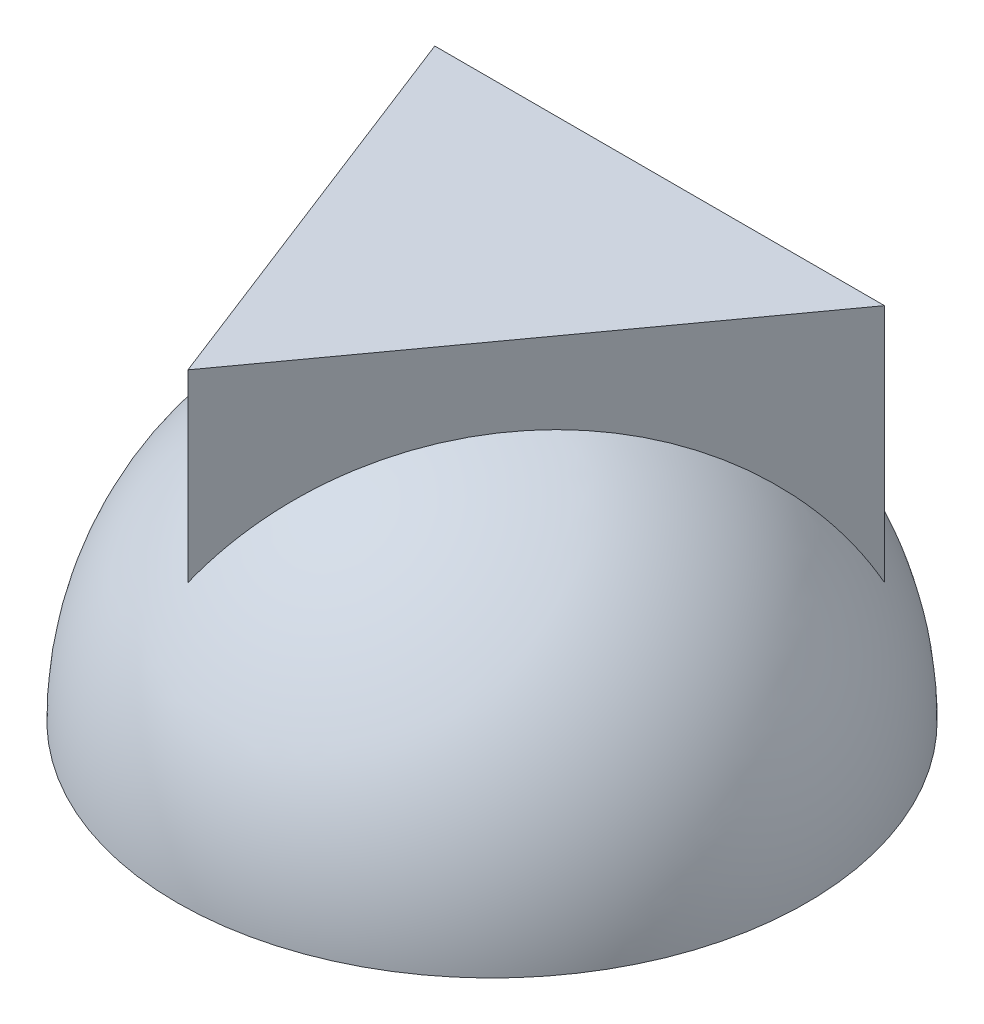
ISO-10303-21;
HEADER;
FILE_DESCRIPTION(('STEP AP214'),'2;1');
FILE_NAME('part.step','',(''),(''),'','','');
FILE_SCHEMA(('AUTOMOTIVE_DESIGN { 1 0 10303 214 1 1 1 1 }'));
ENDSEC;
DATA;
#1=APPLICATION_CONTEXT('core data for automotive mechanical design processes');
#2=APPLICATION_PROTOCOL_DEFINITION('international standard','automotive_design',2000,#1);
#3=PRODUCT_CONTEXT('',#1,'mechanical');
#4=PRODUCT('Part','Part','',(#3));
#5=PRODUCT_RELATED_PRODUCT_CATEGORY('part','',(#4));
#6=PRODUCT_DEFINITION_FORMATION('','',#4);
#7=PRODUCT_DEFINITION_CONTEXT('part definition',#1,'design');
#8=PRODUCT_DEFINITION('design','',#6,#7);
#9=PRODUCT_DEFINITION_SHAPE('','',#8);
#10=(LENGTH_UNIT() NAMED_UNIT(*) SI_UNIT(.MILLI.,.METRE.));
#11=(NAMED_UNIT(*) PLANE_ANGLE_UNIT() SI_UNIT($,.RADIAN.));
#12=(NAMED_UNIT(*) SI_UNIT($,.STERADIAN.) SOLID_ANGLE_UNIT());
#13=UNCERTAINTY_MEASURE_WITH_UNIT(LENGTH_MEASURE(1.E-05),#10,'distance_accuracy_value','');
#14=(GEOMETRIC_REPRESENTATION_CONTEXT(3) GLOBAL_UNCERTAINTY_ASSIGNED_CONTEXT((#13)) GLOBAL_UNIT_ASSIGNED_CONTEXT((#10,
#11,#12)) REPRESENTATION_CONTEXT('',''));
#15=CARTESIAN_POINT('',(0.,0.,0.));
#16=DIRECTION('',(0.,0.,1.));
#17=DIRECTION('',(1.,0.,0.));
#18=AXIS2_PLACEMENT_3D('',#15,#16,#17);
#19=CARTESIAN_POINT('',(0.,0.,0.));
#20=DIRECTION('',(0.,0.,-1.));
#21=DIRECTION('',(-1.,0.,0.));
#22=AXIS2_PLACEMENT_3D('',#19,#20,#21);
#23=SPHERICAL_SURFACE('',#22,38.5);
#24=CARTESIAN_POINT('',(0.,0.,0.));
#25=DIRECTION('',(0.,-1.,0.));
#26=DIRECTION('',(0.,0.,1.));
#27=AXIS2_PLACEMENT_3D('',#24,#25,#26);
#28=CIRCLE('',#27,38.5);
#29=CARTESIAN_POINT('',(0.,0.,38.5));
#30=VERTEX_POINT('',#29);
#31=EDGE_CURVE('E11',#30,#30,#28,.T.);
#32=ORIENTED_EDGE('',*,*,#31,.F.);
#33=EDGE_LOOP('',(#32));
#34=FACE_BOUND('',#33,.T.);
#35=CARTESIAN_POINT('',(0.,0.,-21.));
#36=DIRECTION('',(0.,0.,1.));
#37=DIRECTION('',(1.,0.,0.));
#38=AXIS2_PLACEMENT_3D('',#35,#36,#37);
#39=CIRCLE('',#38,32.2684056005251);
#40=CARTESIAN_POINT('',(27.,17.6705970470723,-21.));
#41=VERTEX_POINT('',#40);
#42=CARTESIAN_POINT('',(-28.,16.0390149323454,-21.));
#43=VERTEX_POINT('',#42);
#44=EDGE_CURVE('E42',#41,#43,#39,.T.);
#45=ORIENTED_EDGE('',*,*,#44,.F.);
#46=CARTESIAN_POINT('',(7.72734738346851,0.,5.59895902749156));
#47=DIRECTION('',(-0.809778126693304,0.,-0.586736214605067));
#48=DIRECTION('',(-0.586736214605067,0.,0.809778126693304));
#49=AXIS2_PLACEMENT_3D('',#46,#47,#48);
#50=CIRCLE('',#49,37.2986562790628);
#51=CARTESIAN_POINT('',(-8.79090909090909,24.4665210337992,28.3964657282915));
#52=VERTEX_POINT('',#51);
#53=EDGE_CURVE('E53',#52,#41,#50,.T.);
#54=ORIENTED_EDGE('',*,*,#53,.F.);
#55=CARTESIAN_POINT('',(-17.2282726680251,0.,6.6996585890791));
#56=DIRECTION('',(0.932008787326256,0.,-0.362435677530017));
#57=DIRECTION('',(-0.362435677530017,0.,-0.932008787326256));
#58=AXIS2_PLACEMENT_3D('',#55,#56,#57);
#59=CIRCLE('',#58,33.7720475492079);
#60=EDGE_CURVE('E49',#43,#52,#59,.T.);
#61=ORIENTED_EDGE('',*,*,#60,.F.);
#62=EDGE_LOOP('',(#45,#54,#61));
#63=FACE_BOUND('',#62,.T.);
#64=ADVANCED_FACE('F35',(#34,#63),#23,.T.);
#65=CARTESIAN_POINT('',(0.,0.,0.));
#66=DIRECTION('',(0.,-1.,0.));
#67=DIRECTION('',(0.,0.,1.));
#68=AXIS2_PLACEMENT_3D('',#65,#66,#67);
#69=PLANE('',#68);
#70=ORIENTED_EDGE('',*,*,#31,.T.);
#71=EDGE_LOOP('',(#70));
#72=FACE_BOUND('',#71,.T.);
#73=ADVANCED_FACE('F104',(#72),#69,.T.);
#74=CARTESIAN_POINT('',(27.,47.,-21.));
#75=DIRECTION('',(0.,0.,1.));
#76=DIRECTION('',(1.,0.,0.));
#77=AXIS2_PLACEMENT_3D('',#74,#75,#76);
#78=PLANE('',#77);
#79=DIRECTION('',(0.,-1.,0.));
#80=VECTOR('',#79,1.);
#81=CARTESIAN_POINT('',(27.,47.,-21.));
#82=LINE('',#81,#80);
#83=CARTESIAN_POINT('',(27.,47.,-21.));
#84=VERTEX_POINT('',#83);
#85=EDGE_CURVE('E88',#84,#41,#82,.T.);
#86=ORIENTED_EDGE('',*,*,#85,.T.);
#87=ORIENTED_EDGE('',*,*,#44,.T.);
#88=DIRECTION('',(0.,-1.,0.));
#89=VECTOR('',#88,1.);
#90=CARTESIAN_POINT('',(-28.,47.,-21.));
#91=LINE('',#90,#89);
#92=CARTESIAN_POINT('',(-28.,47.,-21.));
#93=VERTEX_POINT('',#92);
#94=EDGE_CURVE('E71',#93,#43,#91,.T.);
#95=ORIENTED_EDGE('',*,*,#94,.F.);
#96=DIRECTION('',(-1.,0.,0.));
#97=VECTOR('',#96,1.);
#98=CARTESIAN_POINT('',(27.,47.,-21.));
#99=LINE('',#98,#97);
#100=EDGE_CURVE('E77',#84,#93,#99,.T.);
#101=ORIENTED_EDGE('',*,*,#100,.F.);
#102=EDGE_LOOP('',(#86,#87,#95,#101));
#103=FACE_BOUND('',#102,.T.);
#104=ADVANCED_FACE('F85',(#103),#78,.F.);
#105=CARTESIAN_POINT('',(-28.,47.,-21.));
#106=DIRECTION('',(0.932008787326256,0.,-0.362435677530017));
#107=DIRECTION('',(-0.362435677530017,0.,-0.932008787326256));
#108=AXIS2_PLACEMENT_3D('',#105,#106,#107);
#109=PLANE('',#108);
#110=ORIENTED_EDGE('',*,*,#94,.T.);
#111=ORIENTED_EDGE('',*,*,#60,.T.);
#112=DIRECTION('',(0.,-1.,0.));
#113=VECTOR('',#112,1.);
#114=CARTESIAN_POINT('',(-8.79090909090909,47.,28.3964657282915));
#115=LINE('',#114,#113);
#116=CARTESIAN_POINT('',(-8.79090909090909,47.,28.3964657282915));
#117=VERTEX_POINT('',#116);
#118=EDGE_CURVE('E73',#117,#52,#115,.T.);
#119=ORIENTED_EDGE('',*,*,#118,.F.);
#120=DIRECTION('',(0.362435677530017,0.,0.932008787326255));
#121=VECTOR('',#120,1.);
#122=CARTESIAN_POINT('',(-28.,47.,-21.));
#123=LINE('',#122,#121);
#124=EDGE_CURVE('E67',#93,#117,#123,.T.);
#125=ORIENTED_EDGE('',*,*,#124,.F.);
#126=EDGE_LOOP('',(#110,#111,#119,#125));
#127=FACE_BOUND('',#126,.T.);
#128=ADVANCED_FACE('F69',(#127),#109,.F.);
#129=CARTESIAN_POINT('',(-8.79090909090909,47.,28.3964657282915));
#130=DIRECTION('',(-0.809778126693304,0.,-0.586736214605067));
#131=DIRECTION('',(-0.586736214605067,0.,0.809778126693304));
#132=AXIS2_PLACEMENT_3D('',#129,#130,#131);
#133=PLANE('',#132);
#134=ORIENTED_EDGE('',*,*,#118,.T.);
#135=ORIENTED_EDGE('',*,*,#53,.T.);
#136=ORIENTED_EDGE('',*,*,#85,.F.);
#137=DIRECTION('',(0.586736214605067,0.,-0.809778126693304));
#138=VECTOR('',#137,1.);
#139=CARTESIAN_POINT('',(-8.79090909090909,47.,28.3964657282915));
#140=LINE('',#139,#138);
#141=EDGE_CURVE('E76',#117,#84,#140,.T.);
#142=ORIENTED_EDGE('',*,*,#141,.F.);
#143=EDGE_LOOP('',(#134,#135,#136,#142));
#144=FACE_BOUND('',#143,.T.);
#145=ADVANCED_FACE('F93',(#144),#133,.F.);
#146=CARTESIAN_POINT('',(0.,47.,0.));
#147=DIRECTION('',(0.,1.,0.));
#148=DIRECTION('',(0.,0.,1.));
#149=AXIS2_PLACEMENT_3D('',#146,#147,#148);
#150=PLANE('',#149);
#151=ORIENTED_EDGE('',*,*,#100,.T.);
#152=ORIENTED_EDGE('',*,*,#124,.T.);
#153=ORIENTED_EDGE('',*,*,#141,.T.);
#154=EDGE_LOOP('',(#151,#152,#153));
#155=FACE_BOUND('',#154,.T.);
#156=ADVANCED_FACE('F80',(#155),#150,.T.);
#157=CLOSED_SHELL('',(#64,#73,#104,#128,#145,#156));
#158=MANIFOLD_SOLID_BREP('B2',#157);
#159=ADVANCED_BREP_SHAPE_REPRESENTATION('',(#18,#158),#14);
#160=SHAPE_DEFINITION_REPRESENTATION(#9,#159);
ENDSEC;
END-ISO-10303-21;
